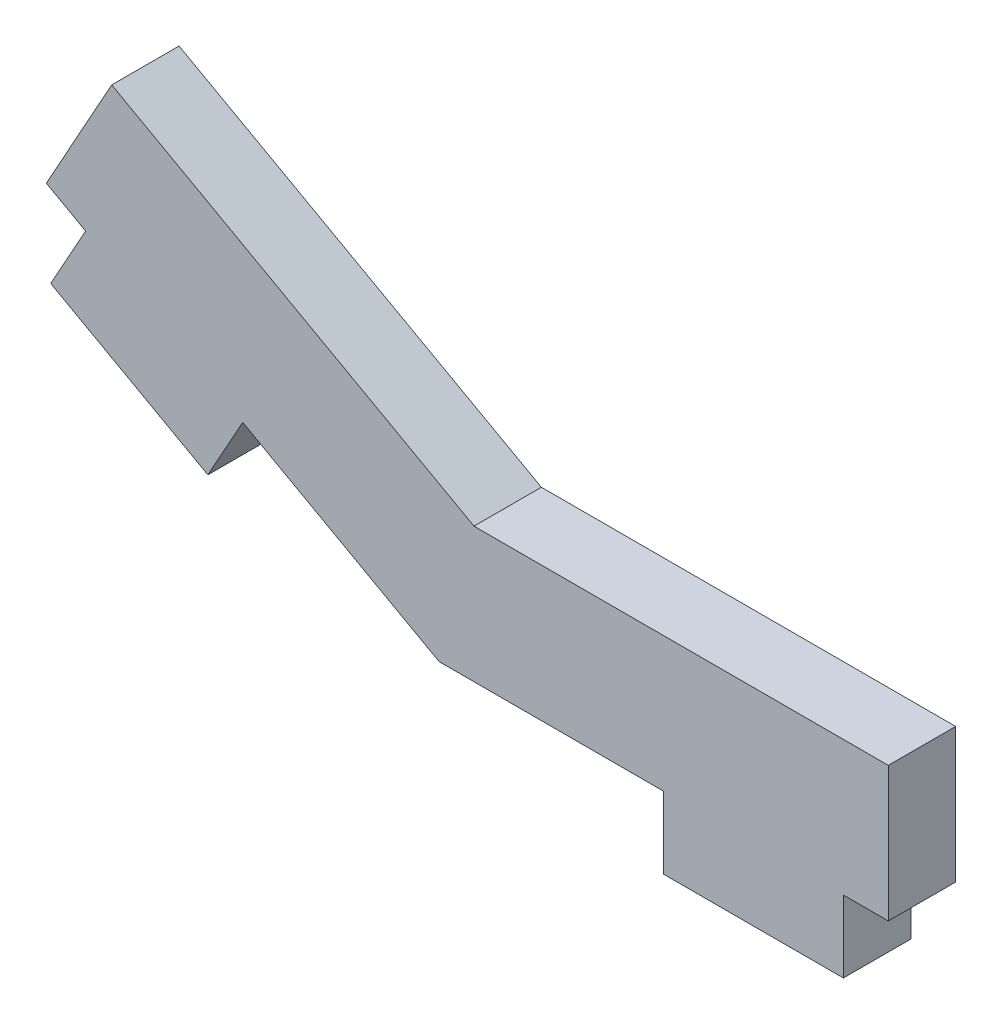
ISO-10303-21;
HEADER;
FILE_DESCRIPTION(('STEP AP214'),'2;1');
FILE_NAME('part.step','',(''),(''),'','','');
FILE_SCHEMA(('AUTOMOTIVE_DESIGN { 1 0 10303 214 1 1 1 1 }'));
ENDSEC;
DATA;
#1=APPLICATION_CONTEXT('core data for automotive mechanical design processes');
#2=APPLICATION_PROTOCOL_DEFINITION('international standard','automotive_design',2000,#1);
#3=PRODUCT_CONTEXT('',#1,'mechanical');
#4=PRODUCT('Part','Part','',(#3));
#5=PRODUCT_RELATED_PRODUCT_CATEGORY('part','',(#4));
#6=PRODUCT_DEFINITION_FORMATION('','',#4);
#7=PRODUCT_DEFINITION_CONTEXT('part definition',#1,'design');
#8=PRODUCT_DEFINITION('design','',#6,#7);
#9=PRODUCT_DEFINITION_SHAPE('','',#8);
#10=(LENGTH_UNIT() NAMED_UNIT(*) SI_UNIT(.MILLI.,.METRE.));
#11=(NAMED_UNIT(*) PLANE_ANGLE_UNIT() SI_UNIT($,.RADIAN.));
#12=(NAMED_UNIT(*) SI_UNIT($,.STERADIAN.) SOLID_ANGLE_UNIT());
#13=UNCERTAINTY_MEASURE_WITH_UNIT(LENGTH_MEASURE(1.E-05),#10,'distance_accuracy_value','');
#14=(GEOMETRIC_REPRESENTATION_CONTEXT(3) GLOBAL_UNCERTAINTY_ASSIGNED_CONTEXT((#13)) GLOBAL_UNIT_ASSIGNED_CONTEXT((#10,
#11,#12)) REPRESENTATION_CONTEXT('',''));
#15=CARTESIAN_POINT('',(0.,0.,0.));
#16=DIRECTION('',(0.,0.,1.));
#17=DIRECTION('',(1.,0.,0.));
#18=AXIS2_PLACEMENT_3D('',#15,#16,#17);
#19=CARTESIAN_POINT('',(0.,0.,3.));
#20=DIRECTION('',(0.,1.,0.));
#21=DIRECTION('',(0.,0.,1.));
#22=AXIS2_PLACEMENT_3D('',#19,#20,#21);
#23=PLANE('',#22);
#24=DIRECTION('',(0.,0.,-1.));
#25=VECTOR('',#24,1.);
#26=CARTESIAN_POINT('',(10.,0.,3.));
#27=LINE('',#26,#25);
#28=CARTESIAN_POINT('',(10.,0.,3.));
#29=VERTEX_POINT('',#28);
#30=CARTESIAN_POINT('',(10.,0.,0.));
#31=VERTEX_POINT('',#30);
#32=EDGE_CURVE('E140',#29,#31,#27,.T.);
#33=ORIENTED_EDGE('',*,*,#32,.F.);
#34=DIRECTION('',(1.,0.,0.));
#35=VECTOR('',#34,1.);
#36=CARTESIAN_POINT('',(0.,0.,3.));
#37=LINE('',#36,#35);
#38=CARTESIAN_POINT('',(0.,0.,3.));
#39=VERTEX_POINT('',#38);
#40=EDGE_CURVE('E157',#39,#29,#37,.T.);
#41=ORIENTED_EDGE('',*,*,#40,.F.);
#42=DIRECTION('',(0.,0.,-1.));
#43=VECTOR('',#42,1.);
#44=CARTESIAN_POINT('',(0.,0.,3.));
#45=LINE('',#44,#43);
#46=CARTESIAN_POINT('',(0.,0.,0.));
#47=VERTEX_POINT('',#46);
#48=EDGE_CURVE('E189',#39,#47,#45,.T.);
#49=ORIENTED_EDGE('',*,*,#48,.T.);
#50=DIRECTION('',(1.,0.,0.));
#51=VECTOR('',#50,1.);
#52=CARTESIAN_POINT('',(0.,0.,0.));
#53=LINE('',#52,#51);
#54=EDGE_CURVE('E184',#47,#31,#53,.T.);
#55=ORIENTED_EDGE('',*,*,#54,.T.);
#56=EDGE_LOOP('',(#33,#41,#49,#55));
#57=FACE_BOUND('',#56,.T.);
#58=ADVANCED_FACE('F35',(#57),#23,.F.);
#59=CARTESIAN_POINT('',(0.,0.,3.));
#60=DIRECTION('',(-0.485114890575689,-0.874450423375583,0.));
#61=DIRECTION('',(0.874450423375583,-0.485114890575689,0.));
#62=AXIS2_PLACEMENT_3D('',#59,#60,#61);
#63=PLANE('',#62);
#64=DIRECTION('',(-0.874450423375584,0.485114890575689,0.));
#65=VECTOR('',#64,1.);
#66=CARTESIAN_POINT('',(0.,0.,0.));
#67=LINE('',#66,#65);
#68=CARTESIAN_POINT('',(-15.7401076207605,8.73206803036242,0.));
#69=VERTEX_POINT('',#68);
#70=CARTESIAN_POINT('',(-17.4890084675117,9.70229781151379,0.));
#71=VERTEX_POINT('',#70);
#72=EDGE_CURVE('E179',#69,#71,#67,.T.);
#73=ORIENTED_EDGE('',*,*,#72,.F.);
#74=DIRECTION('',(0.,0.,-1.));
#75=VECTOR('',#74,1.);
#76=CARTESIAN_POINT('',(-15.7401076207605,8.73206803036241,3.));
#77=LINE('',#76,#75);
#78=CARTESIAN_POINT('',(-15.7401076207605,8.73206803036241,3.));
#79=VERTEX_POINT('',#78);
#80=EDGE_CURVE('E229',#79,#69,#77,.T.);
#81=ORIENTED_EDGE('',*,*,#80,.F.);
#82=DIRECTION('',(-0.874450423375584,0.485114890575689,0.));
#83=VECTOR('',#82,1.);
#84=CARTESIAN_POINT('',(0.,0.,3.));
#85=LINE('',#84,#83);
#86=CARTESIAN_POINT('',(-17.4890084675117,9.70229781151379,3.));
#87=VERTEX_POINT('',#86);
#88=EDGE_CURVE('E162',#79,#87,#85,.T.);
#89=ORIENTED_EDGE('',*,*,#88,.T.);
#90=DIRECTION('',(0.,0.,-1.));
#91=VECTOR('',#90,1.);
#92=CARTESIAN_POINT('',(-17.4890084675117,9.70229781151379,3.));
#93=LINE('',#92,#91);
#94=EDGE_CURVE('E191',#87,#71,#93,.T.);
#95=ORIENTED_EDGE('',*,*,#94,.T.);
#96=EDGE_LOOP('',(#73,#81,#89,#95));
#97=FACE_BOUND('',#96,.T.);
#98=ADVANCED_FACE('F270',(#97),#63,.T.);
#99=CARTESIAN_POINT('',(20.,0.,3.));
#100=DIRECTION('',(1.,0.,0.));
#101=DIRECTION('',(0.,0.,-1.));
#102=AXIS2_PLACEMENT_3D('',#99,#100,#101);
#103=PLANE('',#102);
#104=DIRECTION('',(0.,-1.,0.));
#105=VECTOR('',#104,1.);
#106=CARTESIAN_POINT('',(20.,0.,0.));
#107=LINE('',#106,#105);
#108=CARTESIAN_POINT('',(20.,6.,0.));
#109=VERTEX_POINT('',#108);
#110=CARTESIAN_POINT('',(20.,0.,0.));
#111=VERTEX_POINT('',#110);
#112=EDGE_CURVE('E166',#109,#111,#107,.T.);
#113=ORIENTED_EDGE('',*,*,#112,.F.);
#114=DIRECTION('',(0.,0.,-1.));
#115=VECTOR('',#114,1.);
#116=CARTESIAN_POINT('',(20.,6.,3.));
#117=LINE('',#116,#115);
#118=CARTESIAN_POINT('',(20.,6.,3.));
#119=VERTEX_POINT('',#118);
#120=EDGE_CURVE('E11',#119,#109,#117,.T.);
#121=ORIENTED_EDGE('',*,*,#120,.F.);
#122=DIRECTION('',(0.,-1.,0.));
#123=VECTOR('',#122,1.);
#124=CARTESIAN_POINT('',(20.,0.,3.));
#125=LINE('',#124,#123);
#126=CARTESIAN_POINT('',(20.,0.,3.));
#127=VERTEX_POINT('',#126);
#128=EDGE_CURVE('E187',#119,#127,#125,.T.);
#129=ORIENTED_EDGE('',*,*,#128,.T.);
#130=DIRECTION('',(0.,0.,-1.));
#131=VECTOR('',#130,1.);
#132=CARTESIAN_POINT('',(20.,0.,3.));
#133=LINE('',#132,#131);
#134=EDGE_CURVE('E155',#127,#111,#133,.T.);
#135=ORIENTED_EDGE('',*,*,#134,.T.);
#136=EDGE_LOOP('',(#113,#121,#129,#135));
#137=FACE_BOUND('',#136,.T.);
#138=ADVANCED_FACE('F37',(#137),#103,.T.);
#139=CARTESIAN_POINT('',(0.,6.,3.));
#140=DIRECTION('',(0.,1.,0.));
#141=DIRECTION('',(0.,0.,1.));
#142=AXIS2_PLACEMENT_3D('',#139,#140,#141);
#143=PLANE('',#142);
#144=DIRECTION('',(1.,0.,0.));
#145=VECTOR('',#144,1.);
#146=CARTESIAN_POINT('',(0.,6.,0.));
#147=LINE('',#146,#145);
#148=CARTESIAN_POINT('',(1.55282279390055,6.,0.));
#149=VERTEX_POINT('',#148);
#150=EDGE_CURVE('E169',#149,#109,#147,.T.);
#151=ORIENTED_EDGE('',*,*,#150,.F.);
#152=DIRECTION('',(0.,0.,-1.));
#153=VECTOR('',#152,1.);
#154=CARTESIAN_POINT('',(1.55282279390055,6.,3.));
#155=LINE('',#154,#153);
#156=CARTESIAN_POINT('',(1.55282279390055,6.,3.));
#157=VERTEX_POINT('',#156);
#158=EDGE_CURVE('E43',#157,#149,#155,.T.);
#159=ORIENTED_EDGE('',*,*,#158,.F.);
#160=DIRECTION('',(1.,0.,0.));
#161=VECTOR('',#160,1.);
#162=CARTESIAN_POINT('',(0.,6.,3.));
#163=LINE('',#162,#161);
#164=EDGE_CURVE('E217',#157,#119,#163,.T.);
#165=ORIENTED_EDGE('',*,*,#164,.T.);
#166=ORIENTED_EDGE('',*,*,#120,.T.);
#167=EDGE_LOOP('',(#151,#159,#165,#166));
#168=FACE_BOUND('',#167,.T.);
#169=ADVANCED_FACE('F205',(#168),#143,.T.);
#170=CARTESIAN_POINT('',(2.91068934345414,5.2467025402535,3.));
#171=DIRECTION('',(0.485114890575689,0.874450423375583,0.));
#172=DIRECTION('',(-0.874450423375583,0.485114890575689,0.));
#173=AXIS2_PLACEMENT_3D('',#170,#171,#172);
#174=PLANE('',#173);
#175=DIRECTION('',(0.874450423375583,-0.485114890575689,0.));
#176=VECTOR('',#175,1.);
#177=CARTESIAN_POINT('',(2.91068934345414,5.2467025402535,0.));
#178=LINE('',#177,#176);
#179=CARTESIAN_POINT('',(-14.5783191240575,14.9490003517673,0.));
#180=VERTEX_POINT('',#179);
#181=EDGE_CURVE('E173',#180,#149,#178,.T.);
#182=ORIENTED_EDGE('',*,*,#181,.F.);
#183=DIRECTION('',(0.,0.,-1.));
#184=VECTOR('',#183,1.);
#185=CARTESIAN_POINT('',(-14.5783191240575,14.9490003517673,3.));
#186=LINE('',#185,#184);
#187=CARTESIAN_POINT('',(-14.5783191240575,14.9490003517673,3.));
#188=VERTEX_POINT('',#187);
#189=EDGE_CURVE('E194',#188,#180,#186,.T.);
#190=ORIENTED_EDGE('',*,*,#189,.F.);
#191=DIRECTION('',(0.874450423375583,-0.485114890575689,0.));
#192=VECTOR('',#191,1.);
#193=CARTESIAN_POINT('',(2.91068934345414,5.2467025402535,3.));
#194=LINE('',#193,#192);
#195=EDGE_CURVE('E201',#188,#157,#194,.T.);
#196=ORIENTED_EDGE('',*,*,#195,.T.);
#197=ORIENTED_EDGE('',*,*,#158,.T.);
#198=EDGE_LOOP('',(#182,#190,#196,#197));
#199=FACE_BOUND('',#198,.T.);
#200=ADVANCED_FACE('F199',(#199),#174,.T.);
#201=CARTESIAN_POINT('',(-17.4890084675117,9.70229781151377,3.));
#202=DIRECTION('',(-0.874450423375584,0.485114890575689,0.));
#203=DIRECTION('',(-0.485114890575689,-0.874450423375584,0.));
#204=AXIS2_PLACEMENT_3D('',#201,#202,#203);
#205=PLANE('',#204);
#206=DIRECTION('',(0.485114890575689,0.874450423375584,0.));
#207=VECTOR('',#206,1.);
#208=CARTESIAN_POINT('',(-17.4890084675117,9.70229781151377,0.));
#209=LINE('',#208,#207);
#210=EDGE_CURVE('E176',#71,#180,#209,.T.);
#211=ORIENTED_EDGE('',*,*,#210,.F.);
#212=ORIENTED_EDGE('',*,*,#94,.F.);
#213=DIRECTION('',(0.485114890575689,0.874450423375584,0.));
#214=VECTOR('',#213,1.);
#215=CARTESIAN_POINT('',(-17.4890084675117,9.70229781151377,3.));
#216=LINE('',#215,#214);
#217=EDGE_CURVE('E215',#87,#188,#216,.T.);
#218=ORIENTED_EDGE('',*,*,#217,.T.);
#219=ORIENTED_EDGE('',*,*,#189,.T.);
#220=EDGE_LOOP('',(#211,#212,#218,#219));
#221=FACE_BOUND('',#220,.T.);
#222=ADVANCED_FACE('F212',(#221),#205,.T.);
#223=DIRECTION('',(0.,0.,-1.));
#224=VECTOR('',#223,1.);
#225=CARTESIAN_POINT('',(-8.74450423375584,4.85114890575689,3.));
#226=LINE('',#225,#224);
#227=CARTESIAN_POINT('',(-8.74450423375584,4.85114890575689,3.));
#228=VERTEX_POINT('',#227);
#229=CARTESIAN_POINT('',(-8.74450423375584,4.85114890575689,0.));
#230=VERTEX_POINT('',#229);
#231=EDGE_CURVE('E226',#228,#230,#226,.T.);
#232=ORIENTED_EDGE('',*,*,#231,.T.);
#233=EDGE_CURVE('E180',#47,#230,#67,.T.);
#234=ORIENTED_EDGE('',*,*,#233,.F.);
#235=ORIENTED_EDGE('',*,*,#48,.F.);
#236=EDGE_CURVE('E158',#39,#228,#85,.T.);
#237=ORIENTED_EDGE('',*,*,#236,.T.);
#238=EDGE_LOOP('',(#232,#234,#235,#237));
#239=FACE_BOUND('',#238,.T.);
#240=ADVANCED_FACE('F277',(#239),#63,.T.);
#241=CARTESIAN_POINT('',(18.,0.,3.));
#242=VERTEX_POINT('',#241);
#243=EDGE_CURVE('E145',#242,#127,#37,.T.);
#244=ORIENTED_EDGE('',*,*,#243,.F.);
#245=DIRECTION('',(0.,0.,-1.));
#246=VECTOR('',#245,1.);
#247=CARTESIAN_POINT('',(18.,0.,3.));
#248=LINE('',#247,#246);
#249=CARTESIAN_POINT('',(18.,0.,0.));
#250=VERTEX_POINT('',#249);
#251=EDGE_CURVE('E133',#242,#250,#248,.T.);
#252=ORIENTED_EDGE('',*,*,#251,.T.);
#253=EDGE_CURVE('E183',#250,#111,#53,.T.);
#254=ORIENTED_EDGE('',*,*,#253,.T.);
#255=ORIENTED_EDGE('',*,*,#134,.F.);
#256=EDGE_LOOP('',(#244,#252,#254,#255));
#257=FACE_BOUND('',#256,.T.);
#258=ADVANCED_FACE('F153',(#257),#23,.F.);
#259=CARTESIAN_POINT('',(0.,0.,3.));
#260=DIRECTION('',(0.,0.,1.));
#261=DIRECTION('',(1.,0.,0.));
#262=AXIS2_PLACEMENT_3D('',#259,#260,#261);
#263=PLANE('',#262);
#264=ORIENTED_EDGE('',*,*,#128,.F.);
#265=ORIENTED_EDGE('',*,*,#164,.F.);
#266=ORIENTED_EDGE('',*,*,#195,.F.);
#267=ORIENTED_EDGE('',*,*,#217,.F.);
#268=ORIENTED_EDGE('',*,*,#88,.F.);
#269=DIRECTION('',(-0.485114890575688,-0.874450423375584,0.));
#270=VECTOR('',#269,1.);
#271=CARTESIAN_POINT('',(-15.7401076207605,8.73206803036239,3.));
#272=LINE('',#271,#270);
#273=CARTESIAN_POINT('',(-17.2924752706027,5.93382667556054,3.));
#274=VERTEX_POINT('',#273);
#275=EDGE_CURVE('E235',#79,#274,#272,.T.);
#276=ORIENTED_EDGE('',*,*,#275,.T.);
#277=DIRECTION('',(0.874450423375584,-0.485114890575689,0.));
#278=VECTOR('',#277,1.);
#279=CARTESIAN_POINT('',(-1.5523676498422,-2.79824135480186,3.));
#280=LINE('',#279,#278);
#281=CARTESIAN_POINT('',(-10.296871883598,2.05290755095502,3.));
#282=VERTEX_POINT('',#281);
#283=EDGE_CURVE('E242',#274,#282,#280,.T.);
#284=ORIENTED_EDGE('',*,*,#283,.T.);
#285=DIRECTION('',(-0.485114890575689,-0.874450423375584,0.));
#286=VECTOR('',#285,1.);
#287=CARTESIAN_POINT('',(-8.74450423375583,4.85114890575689,3.));
#288=LINE('',#287,#286);
#289=EDGE_CURVE('E231',#228,#282,#288,.T.);
#290=ORIENTED_EDGE('',*,*,#289,.F.);
#291=ORIENTED_EDGE('',*,*,#236,.F.);
#292=ORIENTED_EDGE('',*,*,#40,.T.);
#293=DIRECTION('',(0.,-1.,0.));
#294=VECTOR('',#293,1.);
#295=CARTESIAN_POINT('',(10.,0.,3.));
#296=LINE('',#295,#294);
#297=CARTESIAN_POINT('',(10.,-3.2,3.));
#298=VERTEX_POINT('',#297);
#299=EDGE_CURVE('E150',#29,#298,#296,.T.);
#300=ORIENTED_EDGE('',*,*,#299,.T.);
#301=DIRECTION('',(1.,0.,0.));
#302=VECTOR('',#301,1.);
#303=CARTESIAN_POINT('',(0.,-3.2,3.));
#304=LINE('',#303,#302);
#305=CARTESIAN_POINT('',(18.,-3.2,3.));
#306=VERTEX_POINT('',#305);
#307=EDGE_CURVE('E148',#298,#306,#304,.T.);
#308=ORIENTED_EDGE('',*,*,#307,.T.);
#309=DIRECTION('',(0.,-1.,0.));
#310=VECTOR('',#309,1.);
#311=CARTESIAN_POINT('',(18.,0.,3.));
#312=LINE('',#311,#310);
#313=EDGE_CURVE('E136',#242,#306,#312,.T.);
#314=ORIENTED_EDGE('',*,*,#313,.F.);
#315=ORIENTED_EDGE('',*,*,#243,.T.);
#316=EDGE_LOOP('',(#264,#265,#266,#267,#268,#276,#284,#290,#291,#292,#300,#308,#314,#315));
#317=FACE_BOUND('',#316,.T.);
#318=ADVANCED_FACE('F144',(#317),#263,.T.);
#319=CARTESIAN_POINT('',(0.,0.,0.));
#320=DIRECTION('',(0.,0.,1.));
#321=DIRECTION('',(1.,0.,0.));
#322=AXIS2_PLACEMENT_3D('',#319,#320,#321);
#323=PLANE('',#322);
#324=ORIENTED_EDGE('',*,*,#112,.T.);
#325=ORIENTED_EDGE('',*,*,#253,.F.);
#326=DIRECTION('',(0.,-1.,0.));
#327=VECTOR('',#326,1.);
#328=CARTESIAN_POINT('',(18.,0.,0.));
#329=LINE('',#328,#327);
#330=CARTESIAN_POINT('',(18.,-3.2,0.));
#331=VERTEX_POINT('',#330);
#332=EDGE_CURVE('E50',#250,#331,#329,.T.);
#333=ORIENTED_EDGE('',*,*,#332,.T.);
#334=DIRECTION('',(1.,0.,0.));
#335=VECTOR('',#334,1.);
#336=CARTESIAN_POINT('',(0.,-3.2,0.));
#337=LINE('',#336,#335);
#338=CARTESIAN_POINT('',(10.,-3.2,0.));
#339=VERTEX_POINT('',#338);
#340=EDGE_CURVE('E151',#339,#331,#337,.T.);
#341=ORIENTED_EDGE('',*,*,#340,.F.);
#342=DIRECTION('',(0.,-1.,0.));
#343=VECTOR('',#342,1.);
#344=CARTESIAN_POINT('',(10.,0.,0.));
#345=LINE('',#344,#343);
#346=EDGE_CURVE('E254',#31,#339,#345,.T.);
#347=ORIENTED_EDGE('',*,*,#346,.F.);
#348=ORIENTED_EDGE('',*,*,#54,.F.);
#349=ORIENTED_EDGE('',*,*,#233,.T.);
#350=DIRECTION('',(-0.485114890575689,-0.874450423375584,0.));
#351=VECTOR('',#350,1.);
#352=CARTESIAN_POINT('',(-8.74450423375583,4.85114890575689,0.));
#353=LINE('',#352,#351);
#354=CARTESIAN_POINT('',(-10.296871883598,2.05290755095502,0.));
#355=VERTEX_POINT('',#354);
#356=EDGE_CURVE('E232',#230,#355,#353,.T.);
#357=ORIENTED_EDGE('',*,*,#356,.T.);
#358=DIRECTION('',(0.874450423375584,-0.485114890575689,0.));
#359=VECTOR('',#358,1.);
#360=CARTESIAN_POINT('',(-1.5523676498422,-2.79824135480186,0.));
#361=LINE('',#360,#359);
#362=CARTESIAN_POINT('',(-17.2924752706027,5.93382667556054,0.));
#363=VERTEX_POINT('',#362);
#364=EDGE_CURVE('E236',#363,#355,#361,.T.);
#365=ORIENTED_EDGE('',*,*,#364,.F.);
#366=DIRECTION('',(-0.485114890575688,-0.874450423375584,0.));
#367=VECTOR('',#366,1.);
#368=CARTESIAN_POINT('',(-15.7401076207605,8.73206803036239,0.));
#369=LINE('',#368,#367);
#370=EDGE_CURVE('E58',#69,#363,#369,.T.);
#371=ORIENTED_EDGE('',*,*,#370,.F.);
#372=ORIENTED_EDGE('',*,*,#72,.T.);
#373=ORIENTED_EDGE('',*,*,#210,.T.);
#374=ORIENTED_EDGE('',*,*,#181,.T.);
#375=ORIENTED_EDGE('',*,*,#150,.T.);
#376=EDGE_LOOP('',(#324,#325,#333,#341,#347,#348,#349,#357,#365,#371,#372,#373,#374,#375));
#377=FACE_BOUND('',#376,.T.);
#378=ADVANCED_FACE('F207',(#377),#323,.F.);
#379=CARTESIAN_POINT('',(-15.7401076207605,8.73206803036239,3.));
#380=DIRECTION('',(0.874450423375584,-0.485114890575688,0.));
#381=DIRECTION('',(0.485114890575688,0.874450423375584,0.));
#382=AXIS2_PLACEMENT_3D('',#379,#380,#381);
#383=PLANE('',#382);
#384=ORIENTED_EDGE('',*,*,#370,.T.);
#385=DIRECTION('',(0.,0.,-1.));
#386=VECTOR('',#385,1.);
#387=CARTESIAN_POINT('',(-17.2924752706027,5.93382667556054,3.));
#388=LINE('',#387,#386);
#389=EDGE_CURVE('E170',#274,#363,#388,.T.);
#390=ORIENTED_EDGE('',*,*,#389,.F.);
#391=ORIENTED_EDGE('',*,*,#275,.F.);
#392=ORIENTED_EDGE('',*,*,#80,.T.);
#393=EDGE_LOOP('',(#384,#390,#391,#392));
#394=FACE_BOUND('',#393,.T.);
#395=ADVANCED_FACE('F345',(#394),#383,.F.);
#396=CARTESIAN_POINT('',(-1.5523676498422,-2.79824135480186,3.));
#397=DIRECTION('',(0.485114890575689,0.874450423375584,0.));
#398=DIRECTION('',(-0.874450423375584,0.485114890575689,0.));
#399=AXIS2_PLACEMENT_3D('',#396,#397,#398);
#400=PLANE('',#399);
#401=ORIENTED_EDGE('',*,*,#364,.T.);
#402=DIRECTION('',(0.,0.,-1.));
#403=VECTOR('',#402,1.);
#404=CARTESIAN_POINT('',(-10.296871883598,2.05290755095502,3.));
#405=LINE('',#404,#403);
#406=EDGE_CURVE('E224',#282,#355,#405,.T.);
#407=ORIENTED_EDGE('',*,*,#406,.F.);
#408=ORIENTED_EDGE('',*,*,#283,.F.);
#409=ORIENTED_EDGE('',*,*,#389,.T.);
#410=EDGE_LOOP('',(#401,#407,#408,#409));
#411=FACE_BOUND('',#410,.T.);
#412=ADVANCED_FACE('F353',(#411),#400,.F.);
#413=CARTESIAN_POINT('',(-8.74450423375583,4.85114890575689,3.));
#414=DIRECTION('',(0.874450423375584,-0.485114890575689,0.));
#415=DIRECTION('',(0.485114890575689,0.874450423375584,0.));
#416=AXIS2_PLACEMENT_3D('',#413,#414,#415);
#417=PLANE('',#416);
#418=ORIENTED_EDGE('',*,*,#356,.F.);
#419=ORIENTED_EDGE('',*,*,#231,.F.);
#420=ORIENTED_EDGE('',*,*,#289,.T.);
#421=ORIENTED_EDGE('',*,*,#406,.T.);
#422=EDGE_LOOP('',(#418,#419,#420,#421));
#423=FACE_BOUND('',#422,.T.);
#424=ADVANCED_FACE('F363',(#423),#417,.T.);
#425=CARTESIAN_POINT('',(18.,0.,3.));
#426=DIRECTION('',(1.,0.,0.));
#427=DIRECTION('',(0.,0.,-1.));
#428=AXIS2_PLACEMENT_3D('',#425,#426,#427);
#429=PLANE('',#428);
#430=ORIENTED_EDGE('',*,*,#332,.F.);
#431=ORIENTED_EDGE('',*,*,#251,.F.);
#432=ORIENTED_EDGE('',*,*,#313,.T.);
#433=DIRECTION('',(0.,0.,-1.));
#434=VECTOR('',#433,1.);
#435=CARTESIAN_POINT('',(18.,-3.2,3.));
#436=LINE('',#435,#434);
#437=EDGE_CURVE('E250',#306,#331,#436,.T.);
#438=ORIENTED_EDGE('',*,*,#437,.T.);
#439=EDGE_LOOP('',(#430,#431,#432,#438));
#440=FACE_BOUND('',#439,.T.);
#441=ADVANCED_FACE('F135',(#440),#429,.T.);
#442=CARTESIAN_POINT('',(10.,0.,3.));
#443=DIRECTION('',(1.,0.,0.));
#444=DIRECTION('',(0.,0.,-1.));
#445=AXIS2_PLACEMENT_3D('',#442,#443,#444);
#446=PLANE('',#445);
#447=ORIENTED_EDGE('',*,*,#346,.T.);
#448=DIRECTION('',(0.,0.,-1.));
#449=VECTOR('',#448,1.);
#450=CARTESIAN_POINT('',(10.,-3.2,3.));
#451=LINE('',#450,#449);
#452=EDGE_CURVE('E247',#298,#339,#451,.T.);
#453=ORIENTED_EDGE('',*,*,#452,.F.);
#454=ORIENTED_EDGE('',*,*,#299,.F.);
#455=ORIENTED_EDGE('',*,*,#32,.T.);
#456=EDGE_LOOP('',(#447,#453,#454,#455));
#457=FACE_BOUND('',#456,.T.);
#458=ADVANCED_FACE('F263',(#457),#446,.F.);
#459=CARTESIAN_POINT('',(0.,-3.2,3.));
#460=DIRECTION('',(0.,1.,0.));
#461=DIRECTION('',(0.,0.,1.));
#462=AXIS2_PLACEMENT_3D('',#459,#460,#461);
#463=PLANE('',#462);
#464=ORIENTED_EDGE('',*,*,#340,.T.);
#465=ORIENTED_EDGE('',*,*,#437,.F.);
#466=ORIENTED_EDGE('',*,*,#307,.F.);
#467=ORIENTED_EDGE('',*,*,#452,.T.);
#468=EDGE_LOOP('',(#464,#465,#466,#467));
#469=FACE_BOUND('',#468,.T.);
#470=ADVANCED_FACE('F267',(#469),#463,.F.);
#471=CLOSED_SHELL('',(#58,#98,#138,#169,#200,#222,#240,#258,#318,#378,#395,#412,#424,#441,#458,#470));
#472=MANIFOLD_SOLID_BREP('B2',#471);
#473=ADVANCED_BREP_SHAPE_REPRESENTATION('',(#18,#472),#14);
#474=SHAPE_DEFINITION_REPRESENTATION(#9,#473);
ENDSEC;
END-ISO-10303-21;
